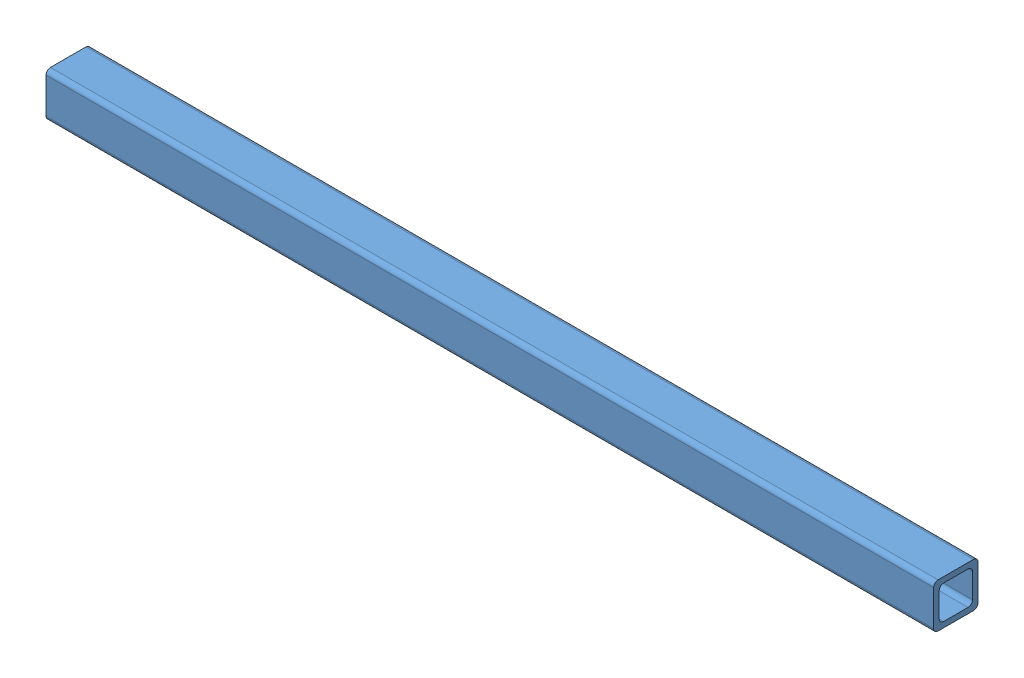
SolidWorks assembly Assemblage3.SLDASM, configuration Défaut (file format 8000). Lengths in mm.
Overall size (400 20 20).
3 component instances, 1 part files, 6 mates.
Components (placement in the parent):
- Assemblage1-1: Assemblage1.SLDASM [Défaut] at (-23.3003 -4.7096 0) (suppressed, hidden)
- Assemblage1-2: Assemblage1.SLDASM [Défaut] at (406.6997 -4.7096 0) (suppressed, hidden)
- piece a soudée 4-1: piece a soudée 4.SLDPRT [Défaut] at (367.6953 -47.9568 6.501) x (0 0 1) z (-1 0 0) size (20 20 400)
Mates (geometry in assembly coordinates):
- Coïncidente9: coincident aligned: plane of ? through (-34.3047 -62.9568 85) normal (0 -1 0); plane of ? through (395.6953 -62.9568 85) normal (0 -1 0)
- Coïncidente11: coincident anti-aligned: plane of ? through (-32.3047 -60.9568 85) normal (1 0 0); plane of piece a soudée 4-1 through (-32.3047 -55.818 -3) normal (-1 0 0)
- Coïncidente12: coincident anti-aligned: plane of ? through (367.6953 -60.9568 85) normal (-1 0 0); plane of piece a soudée 4-1 through (367.6953 -55.818 -3) normal (1 0 0)
- Distance5: distance = 100 mm aligned: plane of piece a soudée 4-1 through (-32.3047 -55.9568 15) normal (0 0 1); plane of ? through (395.6953 -60.9568 115) normal (0 0 1)
- Coïncidente15: coincident aligned: plane of ? through (-34.3047 -60.9568 115) normal (0 0 1); plane of ? through (395.6953 -60.9568 115) normal (0 0 1)
- Distance7: distance = 5 mm aligned: plane of piece a soudée 4-1 through (-32.3047 -37.9568 13) normal (0 1 0); plane of ? through (395.6953 -32.9568 85) normal (0 1 0)
